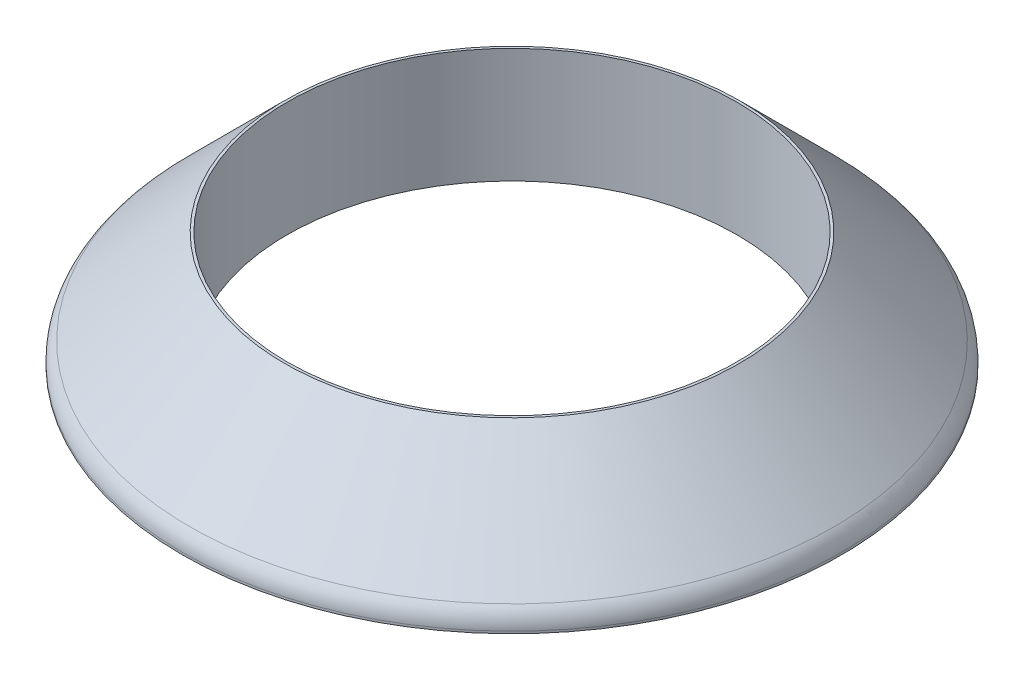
from build123d import *


with BuildPart() as part:
    # Sketch1 → Revolve1 (revolve)
    with BuildSketch(Plane.XY, mode=Mode.PRIVATE) as revolve1_sk:
        with BuildLine():
            Line((-110.49, 0), (-161.838743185, 0))
            Line((-161.838743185, 0), (-161.838743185, 1.089487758))
            ThreePointArc((-161.838743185, 1.089487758), (-160.872013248, 5.949567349), (-158.118999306, 10.069743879))
            Line((-158.118999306, 10.069743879), (-111.76, 56.428743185))
            Line((-111.76, 56.428743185), (-110.49, 56.428743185))
            Line((-110.49, 56.428743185), (-110.49, 0))
        make_face()
        with BuildLine():
            Line((-114.3, 48.500589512), (-114.3, 6.985))
            ThreePointArc((-114.3, 6.985), (-115.22993597, 4.73993597), (-117.475, 3.81))
            Line((-117.475, 3.81), (-151.325461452, 3.81))
            ThreePointArc((-151.325461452, 3.81), (-154.258778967, 5.769980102), (-153.570525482, 9.23006403))
            Line((-153.570525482, 9.23006403), (-114.3, 48.500589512))
        make_face(mode=Mode.SUBTRACT)
    revolve(revolve1_sk.sketch.rotate(Axis((0, 0, 0), (0, 1, 0)), 270), axis=Axis((0, 0, 0), (0, 1, 0)))


solid = part.part
